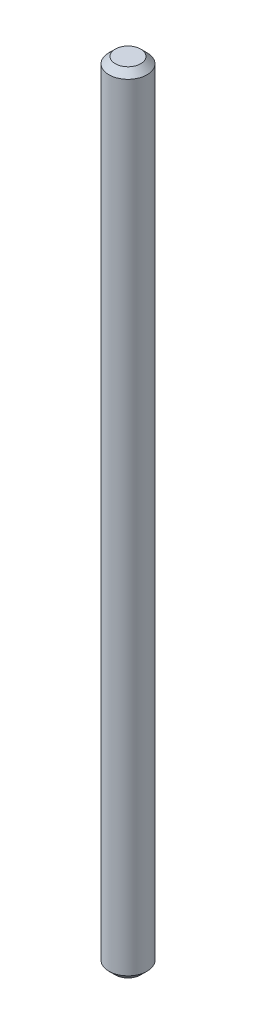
from build123d import *

# Parameters (mm, degrees)
SKETCH1_R           = 1.5
BOSS_EXTRUDE1_DEPTH = 62
CHAMFER1_SIZE       = 0.5


with BuildPart() as part:
    # Sketch1 → Boss-Extrude1 (new body)
    with BuildSketch(Plane(origin=(0, 0, 0), x_dir=(1, 0, 0), z_dir=(0, 1, 0))):
        with Locations(Location((0, 0, 0), (0, 0, 270))):
            Circle(SKETCH1_R)
    extrude(amount=BOSS_EXTRUDE1_DEPTH)

    # Chamfer1
    chamfer1_edges = [part.edges().sort_by_distance(p)[0] for p in [
        (0, 0, -1.5),
        (0, 62, -1.5),
    ]]
    chamfer(chamfer1_edges, length=CHAMFER1_SIZE)


solid = part.part
